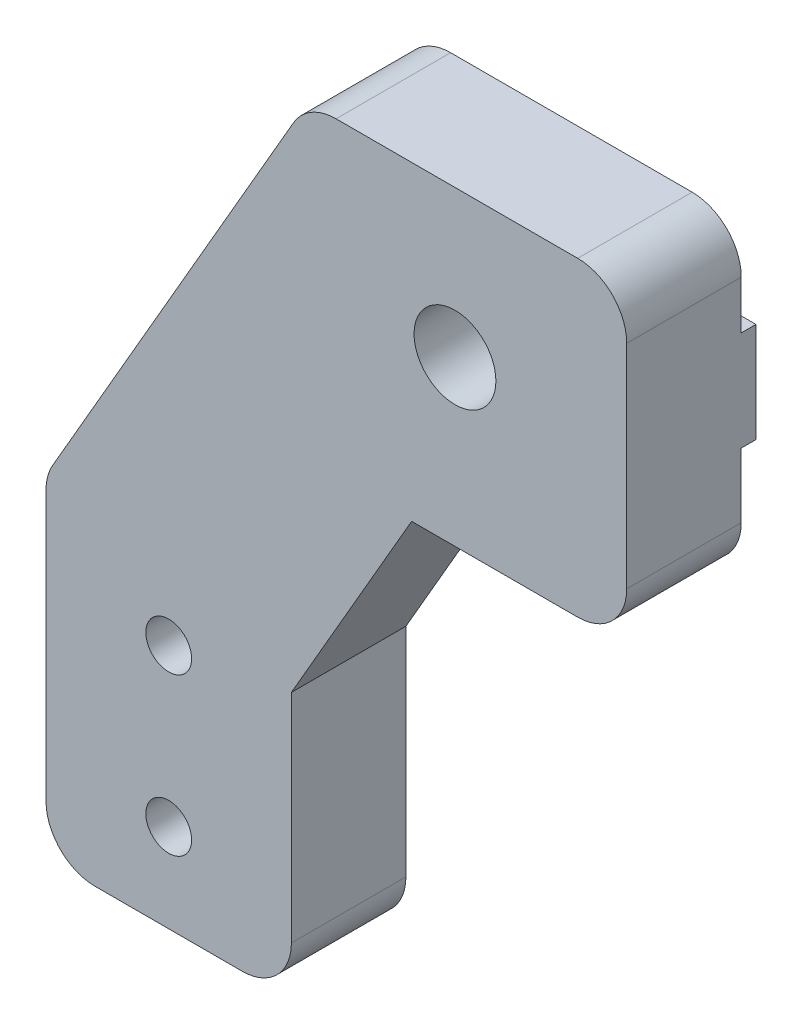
ISO-10303-21;
HEADER;
FILE_DESCRIPTION(('STEP AP214'),'2;1');
FILE_NAME('part.step','',(''),(''),'','','');
FILE_SCHEMA(('AUTOMOTIVE_DESIGN { 1 0 10303 214 1 1 1 1 }'));
ENDSEC;
DATA;
#1=APPLICATION_CONTEXT('core data for automotive mechanical design processes');
#2=APPLICATION_PROTOCOL_DEFINITION('international standard','automotive_design',2000,#1);
#3=PRODUCT_CONTEXT('',#1,'mechanical');
#4=PRODUCT('Part','Part','',(#3));
#5=PRODUCT_RELATED_PRODUCT_CATEGORY('part','',(#4));
#6=PRODUCT_DEFINITION_FORMATION('','',#4);
#7=PRODUCT_DEFINITION_CONTEXT('part definition',#1,'design');
#8=PRODUCT_DEFINITION('design','',#6,#7);
#9=PRODUCT_DEFINITION_SHAPE('','',#8);
#10=(LENGTH_UNIT() NAMED_UNIT(*) SI_UNIT(.MILLI.,.METRE.));
#11=(NAMED_UNIT(*) PLANE_ANGLE_UNIT() SI_UNIT($,.RADIAN.));
#12=(NAMED_UNIT(*) SI_UNIT($,.STERADIAN.) SOLID_ANGLE_UNIT());
#13=UNCERTAINTY_MEASURE_WITH_UNIT(LENGTH_MEASURE(1.E-05),#10,'distance_accuracy_value','');
#14=(GEOMETRIC_REPRESENTATION_CONTEXT(3) GLOBAL_UNCERTAINTY_ASSIGNED_CONTEXT((#13)) GLOBAL_UNIT_ASSIGNED_CONTEXT((#10,
#11,#12)) REPRESENTATION_CONTEXT('',''));
#15=CARTESIAN_POINT('',(0.,0.,0.));
#16=DIRECTION('',(0.,0.,1.));
#17=DIRECTION('',(1.,0.,0.));
#18=AXIS2_PLACEMENT_3D('',#15,#16,#17);
#19=CARTESIAN_POINT('',(3.,19.4833395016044,0.));
#20=DIRECTION('',(0.,0.,-1.));
#21=DIRECTION('',(-1.,0.,0.));
#22=AXIS2_PLACEMENT_3D('',#19,#20,#21);
#23=PLANE('',#22);
#24=CARTESIAN_POINT('',(7.5,15.,0.));
#25=DIRECTION('',(0.,0.,1.));
#26=DIRECTION('',(1.,0.,0.));
#27=AXIS2_PLACEMENT_3D('',#24,#25,#26);
#28=CIRCLE('',#27,1.4);
#29=CARTESIAN_POINT('',(8.9,15.,0.));
#30=VERTEX_POINT('',#29);
#31=EDGE_CURVE('E198',#30,#30,#28,.T.);
#32=ORIENTED_EDGE('',*,*,#31,.T.);
#33=EDGE_LOOP('',(#32));
#34=FACE_BOUND('',#33,.T.);
#35=CARTESIAN_POINT('',(7.5,5.4,0.));
#36=DIRECTION('',(0.,0.,1.));
#37=DIRECTION('',(1.,0.,0.));
#38=AXIS2_PLACEMENT_3D('',#35,#36,#37);
#39=CIRCLE('',#38,1.4);
#40=CARTESIAN_POINT('',(8.9,5.4,0.));
#41=VERTEX_POINT('',#40);
#42=EDGE_CURVE('E197',#41,#41,#39,.T.);
#43=ORIENTED_EDGE('',*,*,#42,.T.);
#44=EDGE_LOOP('',(#43));
#45=FACE_BOUND('',#44,.T.);
#46=DIRECTION('',(-0.499999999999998,-0.86602540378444,0.));
#47=VECTOR('',#46,1.);
#48=CARTESIAN_POINT('',(15.1339745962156,46.5,0.));
#49=LINE('',#48,#47);
#50=CARTESIAN_POINT('',(9.04292925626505,35.95,0.));
#51=VERTEX_POINT('',#50);
#52=CARTESIAN_POINT('',(0.401923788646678,20.9833395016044,0.));
#53=VERTEX_POINT('',#52);
#54=EDGE_CURVE('E55',#51,#53,#49,.T.);
#55=ORIENTED_EDGE('',*,*,#54,.F.);
#56=DIRECTION('',(1.,0.,0.));
#57=VECTOR('',#56,1.);
#58=CARTESIAN_POINT('',(4.16086702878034,35.95,0.));
#59=LINE('',#58,#57);
#60=CARTESIAN_POINT('',(35.5,35.95,0.));
#61=VERTEX_POINT('',#60);
#62=EDGE_CURVE('E50',#51,#61,#59,.T.);
#63=ORIENTED_EDGE('',*,*,#62,.T.);
#64=DIRECTION('',(0.,1.,0.));
#65=VECTOR('',#64,1.);
#66=CARTESIAN_POINT('',(35.5,32.0000000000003,0.));
#67=LINE('',#66,#65);
#68=CARTESIAN_POINT('',(35.5,32.0000000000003,0.));
#69=VERTEX_POINT('',#68);
#70=EDGE_CURVE('E182',#69,#61,#67,.T.);
#71=ORIENTED_EDGE('',*,*,#70,.F.);
#72=CARTESIAN_POINT('',(32.5,32.0000000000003,0.));
#73=DIRECTION('',(0.,0.,1.));
#74=DIRECTION('',(-1.,0.,0.));
#75=AXIS2_PLACEMENT_3D('',#72,#73,#74);
#76=CIRCLE('',#75,3.);
#77=CARTESIAN_POINT('',(32.5,29.0000000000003,0.));
#78=VERTEX_POINT('',#77);
#79=EDGE_CURVE('E257',#78,#69,#76,.T.);
#80=ORIENTED_EDGE('',*,*,#79,.F.);
#81=DIRECTION('',(1.,0.,0.));
#82=VECTOR('',#81,1.);
#83=CARTESIAN_POINT('',(22.3508529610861,29.0000000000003,0.));
#84=LINE('',#83,#82);
#85=CARTESIAN_POINT('',(22.3508529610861,29.0000000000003,0.));
#86=VERTEX_POINT('',#85);
#87=EDGE_CURVE('E255',#86,#78,#84,.T.);
#88=ORIENTED_EDGE('',*,*,#87,.F.);
#89=DIRECTION('',(0.499999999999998,0.86602540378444,0.));
#90=VECTOR('',#89,1.);
#91=CARTESIAN_POINT('',(15.,16.267949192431,0.));
#92=LINE('',#91,#90);
#93=CARTESIAN_POINT('',(15.,16.267949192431,0.));
#94=VERTEX_POINT('',#93);
#95=EDGE_CURVE('E253',#94,#86,#92,.T.);
#96=ORIENTED_EDGE('',*,*,#95,.F.);
#97=DIRECTION('',(0.,1.,0.));
#98=VECTOR('',#97,1.);
#99=CARTESIAN_POINT('',(15.,3.,0.));
#100=LINE('',#99,#98);
#101=CARTESIAN_POINT('',(15.,3.,0.));
#102=VERTEX_POINT('',#101);
#103=EDGE_CURVE('E251',#102,#94,#100,.T.);
#104=ORIENTED_EDGE('',*,*,#103,.F.);
#105=CARTESIAN_POINT('',(12.,3.,0.));
#106=DIRECTION('',(0.,0.,1.));
#107=DIRECTION('',(1.,0.,0.));
#108=AXIS2_PLACEMENT_3D('',#105,#106,#107);
#109=CIRCLE('',#108,3.);
#110=CARTESIAN_POINT('',(12.,0.,0.));
#111=VERTEX_POINT('',#110);
#112=EDGE_CURVE('E249',#111,#102,#109,.T.);
#113=ORIENTED_EDGE('',*,*,#112,.F.);
#114=DIRECTION('',(1.,0.,0.));
#115=VECTOR('',#114,1.);
#116=CARTESIAN_POINT('',(3.00000000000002,0.,0.));
#117=LINE('',#116,#115);
#118=CARTESIAN_POINT('',(3.00000000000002,0.,0.));
#119=VERTEX_POINT('',#118);
#120=EDGE_CURVE('E247',#119,#111,#117,.T.);
#121=ORIENTED_EDGE('',*,*,#120,.F.);
#122=CARTESIAN_POINT('',(3.,3.,0.));
#123=DIRECTION('',(0.,0.,1.));
#124=DIRECTION('',(1.,0.,0.));
#125=AXIS2_PLACEMENT_3D('',#122,#123,#124);
#126=CIRCLE('',#125,3.);
#127=CARTESIAN_POINT('',(0.,3.00000000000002,0.));
#128=VERTEX_POINT('',#127);
#129=EDGE_CURVE('E245',#128,#119,#126,.T.);
#130=ORIENTED_EDGE('',*,*,#129,.F.);
#131=DIRECTION('',(0.,-1.,0.));
#132=VECTOR('',#131,1.);
#133=CARTESIAN_POINT('',(0.,19.4833395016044,0.));
#134=LINE('',#133,#132);
#135=CARTESIAN_POINT('',(0.,19.4833395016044,0.));
#136=VERTEX_POINT('',#135);
#137=EDGE_CURVE('E243',#136,#128,#134,.T.);
#138=ORIENTED_EDGE('',*,*,#137,.F.);
#139=CARTESIAN_POINT('',(3.,19.4833395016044,0.));
#140=DIRECTION('',(0.,0.,1.));
#141=DIRECTION('',(-1.,0.,0.));
#142=AXIS2_PLACEMENT_3D('',#139,#140,#141);
#143=CIRCLE('',#142,3.);
#144=EDGE_CURVE('E209',#53,#136,#143,.T.);
#145=ORIENTED_EDGE('',*,*,#144,.F.);
#146=EDGE_LOOP('',(#55,#63,#71,#80,#88,#96,#104,#113,#121,#130,#138,#145));
#147=FACE_BOUND('',#146,.T.);
#148=ADVANCED_FACE('F33',(#34,#45,#147),#23,.T.);
#149=CARTESIAN_POINT('',(3.,19.4833395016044,7.));
#150=DIRECTION('',(0.,0.,-1.));
#151=DIRECTION('',(-1.,0.,0.));
#152=AXIS2_PLACEMENT_3D('',#149,#150,#151);
#153=PLANE('',#152);
#154=CARTESIAN_POINT('',(3.,19.4833395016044,7.));
#155=DIRECTION('',(0.,0.,1.));
#156=DIRECTION('',(-1.,0.,0.));
#157=AXIS2_PLACEMENT_3D('',#154,#155,#156);
#158=CIRCLE('',#157,3.);
#159=CARTESIAN_POINT('',(0.401923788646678,20.9833395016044,7.));
#160=VERTEX_POINT('',#159);
#161=CARTESIAN_POINT('',(0.,19.4833395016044,7.));
#162=VERTEX_POINT('',#161);
#163=EDGE_CURVE('E210',#160,#162,#158,.T.);
#164=ORIENTED_EDGE('',*,*,#163,.T.);
#165=DIRECTION('',(0.,-1.,0.));
#166=VECTOR('',#165,1.);
#167=CARTESIAN_POINT('',(0.,19.4833395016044,7.));
#168=LINE('',#167,#166);
#169=CARTESIAN_POINT('',(0.,3.00000000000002,7.));
#170=VERTEX_POINT('',#169);
#171=EDGE_CURVE('E213',#162,#170,#168,.T.);
#172=ORIENTED_EDGE('',*,*,#171,.T.);
#173=CARTESIAN_POINT('',(3.,3.,7.));
#174=DIRECTION('',(0.,0.,1.));
#175=DIRECTION('',(1.,0.,0.));
#176=AXIS2_PLACEMENT_3D('',#173,#174,#175);
#177=CIRCLE('',#176,3.);
#178=CARTESIAN_POINT('',(3.00000000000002,0.,7.));
#179=VERTEX_POINT('',#178);
#180=EDGE_CURVE('E216',#170,#179,#177,.T.);
#181=ORIENTED_EDGE('',*,*,#180,.T.);
#182=DIRECTION('',(1.,0.,0.));
#183=VECTOR('',#182,1.);
#184=CARTESIAN_POINT('',(3.00000000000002,0.,7.));
#185=LINE('',#184,#183);
#186=CARTESIAN_POINT('',(12.,0.,7.));
#187=VERTEX_POINT('',#186);
#188=EDGE_CURVE('E218',#179,#187,#185,.T.);
#189=ORIENTED_EDGE('',*,*,#188,.T.);
#190=CARTESIAN_POINT('',(12.,3.,7.));
#191=DIRECTION('',(0.,0.,1.));
#192=DIRECTION('',(1.,0.,0.));
#193=AXIS2_PLACEMENT_3D('',#190,#191,#192);
#194=CIRCLE('',#193,3.);
#195=CARTESIAN_POINT('',(15.,3.,7.));
#196=VERTEX_POINT('',#195);
#197=EDGE_CURVE('E220',#187,#196,#194,.T.);
#198=ORIENTED_EDGE('',*,*,#197,.T.);
#199=DIRECTION('',(0.,1.,0.));
#200=VECTOR('',#199,1.);
#201=CARTESIAN_POINT('',(15.,3.,7.));
#202=LINE('',#201,#200);
#203=CARTESIAN_POINT('',(15.,16.267949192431,7.));
#204=VERTEX_POINT('',#203);
#205=EDGE_CURVE('E222',#196,#204,#202,.T.);
#206=ORIENTED_EDGE('',*,*,#205,.T.);
#207=DIRECTION('',(0.499999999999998,0.86602540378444,0.));
#208=VECTOR('',#207,1.);
#209=CARTESIAN_POINT('',(15.,16.267949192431,7.));
#210=LINE('',#209,#208);
#211=CARTESIAN_POINT('',(22.3508529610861,29.0000000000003,7.));
#212=VERTEX_POINT('',#211);
#213=EDGE_CURVE('E224',#204,#212,#210,.T.);
#214=ORIENTED_EDGE('',*,*,#213,.T.);
#215=DIRECTION('',(1.,0.,0.));
#216=VECTOR('',#215,1.);
#217=CARTESIAN_POINT('',(22.3508529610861,29.0000000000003,7.));
#218=LINE('',#217,#216);
#219=CARTESIAN_POINT('',(32.5,29.0000000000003,7.));
#220=VERTEX_POINT('',#219);
#221=EDGE_CURVE('E226',#212,#220,#218,.T.);
#222=ORIENTED_EDGE('',*,*,#221,.T.);
#223=CARTESIAN_POINT('',(32.5,32.0000000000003,7.));
#224=DIRECTION('',(0.,0.,1.));
#225=DIRECTION('',(-1.,0.,0.));
#226=AXIS2_PLACEMENT_3D('',#223,#224,#225);
#227=CIRCLE('',#226,3.);
#228=CARTESIAN_POINT('',(35.5,32.0000000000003,7.));
#229=VERTEX_POINT('',#228);
#230=EDGE_CURVE('E228',#220,#229,#227,.T.);
#231=ORIENTED_EDGE('',*,*,#230,.T.);
#232=DIRECTION('',(0.,1.,0.));
#233=VECTOR('',#232,1.);
#234=CARTESIAN_POINT('',(35.5,32.0000000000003,7.));
#235=LINE('',#234,#233);
#236=CARTESIAN_POINT('',(35.5,45.,7.));
#237=VERTEX_POINT('',#236);
#238=EDGE_CURVE('E230',#229,#237,#235,.T.);
#239=ORIENTED_EDGE('',*,*,#238,.T.);
#240=CARTESIAN_POINT('',(32.5,45.,7.));
#241=DIRECTION('',(0.,0.,1.));
#242=DIRECTION('',(1.,0.,0.));
#243=AXIS2_PLACEMENT_3D('',#240,#241,#242);
#244=CIRCLE('',#243,3.);
#245=CARTESIAN_POINT('',(32.5,48.,7.));
#246=VERTEX_POINT('',#245);
#247=EDGE_CURVE('E232',#237,#246,#244,.T.);
#248=ORIENTED_EDGE('',*,*,#247,.T.);
#249=DIRECTION('',(-1.,0.,0.));
#250=VECTOR('',#249,1.);
#251=CARTESIAN_POINT('',(32.5,48.,7.));
#252=LINE('',#251,#250);
#253=CARTESIAN_POINT('',(17.7320508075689,48.,7.));
#254=VERTEX_POINT('',#253);
#255=EDGE_CURVE('E234',#246,#254,#252,.T.);
#256=ORIENTED_EDGE('',*,*,#255,.T.);
#257=CARTESIAN_POINT('',(17.7320508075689,45.,7.));
#258=DIRECTION('',(0.,0.,1.));
#259=DIRECTION('',(-1.,0.,0.));
#260=AXIS2_PLACEMENT_3D('',#257,#258,#259);
#261=CIRCLE('',#260,3.00000000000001);
#262=CARTESIAN_POINT('',(15.1339745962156,46.5,7.));
#263=VERTEX_POINT('',#262);
#264=EDGE_CURVE('E236',#254,#263,#261,.T.);
#265=ORIENTED_EDGE('',*,*,#264,.T.);
#266=DIRECTION('',(-0.499999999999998,-0.86602540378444,0.));
#267=VECTOR('',#266,1.);
#268=CARTESIAN_POINT('',(15.1339745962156,46.5,7.));
#269=LINE('',#268,#267);
#270=EDGE_CURVE('E238',#263,#160,#269,.T.);
#271=ORIENTED_EDGE('',*,*,#270,.T.);
#272=EDGE_LOOP('',(#164,#172,#181,#189,#198,#206,#214,#222,#231,#239,#248,#256,#265,#271));
#273=FACE_BOUND('',#272,.T.);
#274=CARTESIAN_POINT('',(25.,39.,7.));
#275=DIRECTION('',(0.,0.,1.));
#276=DIRECTION('',(1.,0.,0.));
#277=AXIS2_PLACEMENT_3D('',#274,#275,#276);
#278=CIRCLE('',#277,2.50000000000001);
#279=CARTESIAN_POINT('',(27.5,39.,7.));
#280=VERTEX_POINT('',#279);
#281=EDGE_CURVE('E204',#280,#280,#278,.T.);
#282=ORIENTED_EDGE('',*,*,#281,.F.);
#283=EDGE_LOOP('',(#282));
#284=FACE_BOUND('',#283,.T.);
#285=CARTESIAN_POINT('',(7.5,5.4,7.));
#286=DIRECTION('',(0.,0.,1.));
#287=DIRECTION('',(1.,0.,0.));
#288=AXIS2_PLACEMENT_3D('',#285,#286,#287);
#289=CIRCLE('',#288,1.4);
#290=CARTESIAN_POINT('',(8.9,5.4,7.));
#291=VERTEX_POINT('',#290);
#292=EDGE_CURVE('E201',#291,#291,#289,.T.);
#293=ORIENTED_EDGE('',*,*,#292,.F.);
#294=EDGE_LOOP('',(#293));
#295=FACE_BOUND('',#294,.T.);
#296=CARTESIAN_POINT('',(7.5,15.,7.));
#297=DIRECTION('',(0.,0.,1.));
#298=DIRECTION('',(1.,0.,0.));
#299=AXIS2_PLACEMENT_3D('',#296,#297,#298);
#300=CIRCLE('',#299,1.4);
#301=CARTESIAN_POINT('',(8.9,15.,7.));
#302=VERTEX_POINT('',#301);
#303=EDGE_CURVE('E194',#302,#302,#300,.T.);
#304=ORIENTED_EDGE('',*,*,#303,.F.);
#305=EDGE_LOOP('',(#304));
#306=FACE_BOUND('',#305,.T.);
#307=ADVANCED_FACE('F331',(#273,#284,#295,#306),#153,.F.);
#308=DIRECTION('',(1.,0.,0.));
#309=VECTOR('',#308,1.);
#310=CARTESIAN_POINT('',(4.16086702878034,42.05,0.));
#311=LINE('',#310,#309);
#312=CARTESIAN_POINT('',(12.5647658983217,42.05,0.));
#313=VERTEX_POINT('',#312);
#314=CARTESIAN_POINT('',(35.5,42.05,0.));
#315=VERTEX_POINT('',#314);
#316=EDGE_CURVE('E352',#313,#315,#311,.T.);
#317=ORIENTED_EDGE('',*,*,#316,.F.);
#318=CARTESIAN_POINT('',(15.1339745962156,46.5,0.));
#319=VERTEX_POINT('',#318);
#320=EDGE_CURVE('E214',#319,#313,#49,.T.);
#321=ORIENTED_EDGE('',*,*,#320,.F.);
#322=CARTESIAN_POINT('',(17.7320508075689,45.,0.));
#323=DIRECTION('',(0.,0.,1.));
#324=DIRECTION('',(-1.,0.,0.));
#325=AXIS2_PLACEMENT_3D('',#322,#323,#324);
#326=CIRCLE('',#325,3.00000000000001);
#327=CARTESIAN_POINT('',(17.7320508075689,48.,0.));
#328=VERTEX_POINT('',#327);
#329=EDGE_CURVE('E271',#328,#319,#326,.T.);
#330=ORIENTED_EDGE('',*,*,#329,.F.);
#331=DIRECTION('',(-1.,0.,0.));
#332=VECTOR('',#331,1.);
#333=CARTESIAN_POINT('',(32.5,48.,0.));
#334=LINE('',#333,#332);
#335=CARTESIAN_POINT('',(32.5,48.,0.));
#336=VERTEX_POINT('',#335);
#337=EDGE_CURVE('E370',#336,#328,#334,.T.);
#338=ORIENTED_EDGE('',*,*,#337,.F.);
#339=CARTESIAN_POINT('',(32.5,45.,0.));
#340=DIRECTION('',(0.,0.,1.));
#341=DIRECTION('',(1.,0.,0.));
#342=AXIS2_PLACEMENT_3D('',#339,#340,#341);
#343=CIRCLE('',#342,3.);
#344=CARTESIAN_POINT('',(35.5,45.,0.));
#345=VERTEX_POINT('',#344);
#346=EDGE_CURVE('E262',#345,#336,#343,.T.);
#347=ORIENTED_EDGE('',*,*,#346,.F.);
#348=EDGE_CURVE('E259',#315,#345,#67,.T.);
#349=ORIENTED_EDGE('',*,*,#348,.F.);
#350=EDGE_LOOP('',(#317,#321,#330,#338,#347,#349));
#351=FACE_BOUND('',#350,.T.);
#352=ADVANCED_FACE('F368',(#351),#23,.T.);
#353=CARTESIAN_POINT('',(3.,19.4833395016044,7.));
#354=DIRECTION('',(0.,0.,-1.));
#355=DIRECTION('',(-1.,0.,0.));
#356=AXIS2_PLACEMENT_3D('',#353,#354,#355);
#357=CYLINDRICAL_SURFACE('',#356,3.);
#358=ORIENTED_EDGE('',*,*,#144,.T.);
#359=DIRECTION('',(0.,0.,-1.));
#360=VECTOR('',#359,1.);
#361=CARTESIAN_POINT('',(0.,19.4833395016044,7.));
#362=LINE('',#361,#360);
#363=EDGE_CURVE('E11',#162,#136,#362,.T.);
#364=ORIENTED_EDGE('',*,*,#363,.F.);
#365=ORIENTED_EDGE('',*,*,#163,.F.);
#366=DIRECTION('',(0.,0.,-1.));
#367=VECTOR('',#366,1.);
#368=CARTESIAN_POINT('',(0.401923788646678,20.9833395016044,7.));
#369=LINE('',#368,#367);
#370=EDGE_CURVE('E240',#160,#53,#369,.T.);
#371=ORIENTED_EDGE('',*,*,#370,.T.);
#372=EDGE_LOOP('',(#358,#364,#365,#371));
#373=FACE_BOUND('',#372,.T.);
#374=ADVANCED_FACE('F35',(#373),#357,.T.);
#375=CARTESIAN_POINT('',(0.,19.4833395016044,7.));
#376=DIRECTION('',(1.,0.,0.));
#377=DIRECTION('',(0.,0.,-1.));
#378=AXIS2_PLACEMENT_3D('',#375,#376,#377);
#379=PLANE('',#378);
#380=ORIENTED_EDGE('',*,*,#137,.T.);
#381=DIRECTION('',(0.,0.,-1.));
#382=VECTOR('',#381,1.);
#383=CARTESIAN_POINT('',(0.,3.00000000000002,7.));
#384=LINE('',#383,#382);
#385=EDGE_CURVE('E42',#170,#128,#384,.T.);
#386=ORIENTED_EDGE('',*,*,#385,.F.);
#387=ORIENTED_EDGE('',*,*,#171,.F.);
#388=ORIENTED_EDGE('',*,*,#363,.T.);
#389=EDGE_LOOP('',(#380,#386,#387,#388));
#390=FACE_BOUND('',#389,.T.);
#391=ADVANCED_FACE('F336',(#390),#379,.F.);
#392=CARTESIAN_POINT('',(3.,3.,7.));
#393=DIRECTION('',(0.,0.,-1.));
#394=DIRECTION('',(-1.,0.,0.));
#395=AXIS2_PLACEMENT_3D('',#392,#393,#394);
#396=CYLINDRICAL_SURFACE('',#395,3.);
#397=ORIENTED_EDGE('',*,*,#129,.T.);
#398=DIRECTION('',(0.,0.,-1.));
#399=VECTOR('',#398,1.);
#400=CARTESIAN_POINT('',(3.00000000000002,0.,7.));
#401=LINE('',#400,#399);
#402=EDGE_CURVE('E307',#179,#119,#401,.T.);
#403=ORIENTED_EDGE('',*,*,#402,.F.);
#404=ORIENTED_EDGE('',*,*,#180,.F.);
#405=ORIENTED_EDGE('',*,*,#385,.T.);
#406=EDGE_LOOP('',(#397,#403,#404,#405));
#407=FACE_BOUND('',#406,.T.);
#408=ADVANCED_FACE('F315',(#407),#396,.T.);
#409=CARTESIAN_POINT('',(3.00000000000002,0.,7.));
#410=DIRECTION('',(0.,1.,0.));
#411=DIRECTION('',(0.,0.,1.));
#412=AXIS2_PLACEMENT_3D('',#409,#410,#411);
#413=PLANE('',#412);
#414=ORIENTED_EDGE('',*,*,#120,.T.);
#415=DIRECTION('',(0.,0.,-1.));
#416=VECTOR('',#415,1.);
#417=CARTESIAN_POINT('',(12.,0.,7.));
#418=LINE('',#417,#416);
#419=EDGE_CURVE('E304',#187,#111,#418,.T.);
#420=ORIENTED_EDGE('',*,*,#419,.F.);
#421=ORIENTED_EDGE('',*,*,#188,.F.);
#422=ORIENTED_EDGE('',*,*,#402,.T.);
#423=EDGE_LOOP('',(#414,#420,#421,#422));
#424=FACE_BOUND('',#423,.T.);
#425=ADVANCED_FACE('F323',(#424),#413,.F.);
#426=CARTESIAN_POINT('',(12.,3.,7.));
#427=DIRECTION('',(0.,0.,-1.));
#428=DIRECTION('',(-1.,0.,0.));
#429=AXIS2_PLACEMENT_3D('',#426,#427,#428);
#430=CYLINDRICAL_SURFACE('',#429,3.);
#431=ORIENTED_EDGE('',*,*,#112,.T.);
#432=DIRECTION('',(0.,0.,-1.));
#433=VECTOR('',#432,1.);
#434=CARTESIAN_POINT('',(15.,3.,7.));
#435=LINE('',#434,#433);
#436=EDGE_CURVE('E301',#196,#102,#435,.T.);
#437=ORIENTED_EDGE('',*,*,#436,.F.);
#438=ORIENTED_EDGE('',*,*,#197,.F.);
#439=ORIENTED_EDGE('',*,*,#419,.T.);
#440=EDGE_LOOP('',(#431,#437,#438,#439));
#441=FACE_BOUND('',#440,.T.);
#442=ADVANCED_FACE('F327',(#441),#430,.T.);
#443=CARTESIAN_POINT('',(15.,3.,7.));
#444=DIRECTION('',(-1.,0.,0.));
#445=DIRECTION('',(0.,0.,1.));
#446=AXIS2_PLACEMENT_3D('',#443,#444,#445);
#447=PLANE('',#446);
#448=ORIENTED_EDGE('',*,*,#103,.T.);
#449=DIRECTION('',(0.,0.,-1.));
#450=VECTOR('',#449,1.);
#451=CARTESIAN_POINT('',(15.,16.267949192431,7.));
#452=LINE('',#451,#450);
#453=EDGE_CURVE('E298',#204,#94,#452,.T.);
#454=ORIENTED_EDGE('',*,*,#453,.F.);
#455=ORIENTED_EDGE('',*,*,#205,.F.);
#456=ORIENTED_EDGE('',*,*,#436,.T.);
#457=EDGE_LOOP('',(#448,#454,#455,#456));
#458=FACE_BOUND('',#457,.T.);
#459=ADVANCED_FACE('F396',(#458),#447,.F.);
#460=CARTESIAN_POINT('',(15.,16.267949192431,7.));
#461=DIRECTION('',(-0.86602540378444,0.499999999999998,0.));
#462=DIRECTION('',(-0.499999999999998,-0.86602540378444,0.));
#463=AXIS2_PLACEMENT_3D('',#460,#461,#462);
#464=PLANE('',#463);
#465=ORIENTED_EDGE('',*,*,#95,.T.);
#466=DIRECTION('',(0.,0.,-1.));
#467=VECTOR('',#466,1.);
#468=CARTESIAN_POINT('',(22.3508529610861,29.0000000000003,7.));
#469=LINE('',#468,#467);
#470=EDGE_CURVE('E295',#212,#86,#469,.T.);
#471=ORIENTED_EDGE('',*,*,#470,.F.);
#472=ORIENTED_EDGE('',*,*,#213,.F.);
#473=ORIENTED_EDGE('',*,*,#453,.T.);
#474=EDGE_LOOP('',(#465,#471,#472,#473));
#475=FACE_BOUND('',#474,.T.);
#476=ADVANCED_FACE('F394',(#475),#464,.F.);
#477=CARTESIAN_POINT('',(22.3508529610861,29.0000000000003,7.));
#478=DIRECTION('',(0.,1.,0.));
#479=DIRECTION('',(-1.,0.,0.));
#480=AXIS2_PLACEMENT_3D('',#477,#478,#479);
#481=PLANE('',#480);
#482=ORIENTED_EDGE('',*,*,#87,.T.);
#483=DIRECTION('',(0.,0.,-1.));
#484=VECTOR('',#483,1.);
#485=CARTESIAN_POINT('',(32.5,29.0000000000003,7.));
#486=LINE('',#485,#484);
#487=EDGE_CURVE('E292',#220,#78,#486,.T.);
#488=ORIENTED_EDGE('',*,*,#487,.F.);
#489=ORIENTED_EDGE('',*,*,#221,.F.);
#490=ORIENTED_EDGE('',*,*,#470,.T.);
#491=EDGE_LOOP('',(#482,#488,#489,#490));
#492=FACE_BOUND('',#491,.T.);
#493=ADVANCED_FACE('F390',(#492),#481,.F.);
#494=CARTESIAN_POINT('',(32.5,32.0000000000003,7.));
#495=DIRECTION('',(0.,0.,-1.));
#496=DIRECTION('',(-1.,0.,0.));
#497=AXIS2_PLACEMENT_3D('',#494,#495,#496);
#498=CYLINDRICAL_SURFACE('',#497,3.);
#499=ORIENTED_EDGE('',*,*,#79,.T.);
#500=DIRECTION('',(0.,0.,-1.));
#501=VECTOR('',#500,1.);
#502=CARTESIAN_POINT('',(35.5,32.0000000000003,7.));
#503=LINE('',#502,#501);
#504=EDGE_CURVE('E290',#229,#69,#503,.T.);
#505=ORIENTED_EDGE('',*,*,#504,.F.);
#506=ORIENTED_EDGE('',*,*,#230,.F.);
#507=ORIENTED_EDGE('',*,*,#487,.T.);
#508=EDGE_LOOP('',(#499,#505,#506,#507));
#509=FACE_BOUND('',#508,.T.);
#510=ADVANCED_FACE('F386',(#509),#498,.T.);
#511=CARTESIAN_POINT('',(35.5,32.0000000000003,7.));
#512=DIRECTION('',(-1.,0.,0.));
#513=DIRECTION('',(0.,0.,1.));
#514=AXIS2_PLACEMENT_3D('',#511,#512,#513);
#515=PLANE('',#514);
#516=ORIENTED_EDGE('',*,*,#70,.T.);
#517=DIRECTION('',(0.,0.,-1.));
#518=VECTOR('',#517,1.);
#519=CARTESIAN_POINT('',(35.5,35.95,0.));
#520=LINE('',#519,#518);
#521=CARTESIAN_POINT('',(35.5,35.95,-0.900000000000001));
#522=VERTEX_POINT('',#521);
#523=EDGE_CURVE('E165',#61,#522,#520,.T.);
#524=ORIENTED_EDGE('',*,*,#523,.T.);
#525=DIRECTION('',(0.,-1.,0.));
#526=VECTOR('',#525,1.);
#527=CARTESIAN_POINT('',(35.5,42.05,-0.9));
#528=LINE('',#527,#526);
#529=CARTESIAN_POINT('',(35.5,42.05,-0.9));
#530=VERTEX_POINT('',#529);
#531=EDGE_CURVE('E172',#530,#522,#528,.T.);
#532=ORIENTED_EDGE('',*,*,#531,.F.);
#533=DIRECTION('',(0.,0.,-1.));
#534=VECTOR('',#533,1.);
#535=CARTESIAN_POINT('',(35.5,42.05,0.));
#536=LINE('',#535,#534);
#537=EDGE_CURVE('E178',#315,#530,#536,.T.);
#538=ORIENTED_EDGE('',*,*,#537,.F.);
#539=ORIENTED_EDGE('',*,*,#348,.T.);
#540=DIRECTION('',(0.,0.,-1.));
#541=VECTOR('',#540,1.);
#542=CARTESIAN_POINT('',(35.5,45.,7.));
#543=LINE('',#542,#541);
#544=EDGE_CURVE('E287',#237,#345,#543,.T.);
#545=ORIENTED_EDGE('',*,*,#544,.F.);
#546=ORIENTED_EDGE('',*,*,#238,.F.);
#547=ORIENTED_EDGE('',*,*,#504,.T.);
#548=EDGE_LOOP('',(#516,#524,#532,#538,#539,#545,#546,#547));
#549=FACE_BOUND('',#548,.T.);
#550=ADVANCED_FACE('F180',(#549),#515,.F.);
#551=CARTESIAN_POINT('',(32.5,45.,7.));
#552=DIRECTION('',(0.,0.,-1.));
#553=DIRECTION('',(-1.,0.,0.));
#554=AXIS2_PLACEMENT_3D('',#551,#552,#553);
#555=CYLINDRICAL_SURFACE('',#554,3.);
#556=ORIENTED_EDGE('',*,*,#346,.T.);
#557=DIRECTION('',(0.,0.,-1.));
#558=VECTOR('',#557,1.);
#559=CARTESIAN_POINT('',(32.5,48.,7.));
#560=LINE('',#559,#558);
#561=EDGE_CURVE('E284',#246,#336,#560,.T.);
#562=ORIENTED_EDGE('',*,*,#561,.F.);
#563=ORIENTED_EDGE('',*,*,#247,.F.);
#564=ORIENTED_EDGE('',*,*,#544,.T.);
#565=EDGE_LOOP('',(#556,#562,#563,#564));
#566=FACE_BOUND('',#565,.T.);
#567=ADVANCED_FACE('F365',(#566),#555,.T.);
#568=CARTESIAN_POINT('',(32.5,48.,7.));
#569=DIRECTION('',(0.,-1.,0.));
#570=DIRECTION('',(0.,0.,-1.));
#571=AXIS2_PLACEMENT_3D('',#568,#569,#570);
#572=PLANE('',#571);
#573=ORIENTED_EDGE('',*,*,#337,.T.);
#574=DIRECTION('',(0.,0.,-1.));
#575=VECTOR('',#574,1.);
#576=CARTESIAN_POINT('',(17.7320508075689,48.,7.));
#577=LINE('',#576,#575);
#578=EDGE_CURVE('E281',#254,#328,#577,.T.);
#579=ORIENTED_EDGE('',*,*,#578,.F.);
#580=ORIENTED_EDGE('',*,*,#255,.F.);
#581=ORIENTED_EDGE('',*,*,#561,.T.);
#582=EDGE_LOOP('',(#573,#579,#580,#581));
#583=FACE_BOUND('',#582,.T.);
#584=ADVANCED_FACE('F379',(#583),#572,.F.);
#585=CARTESIAN_POINT('',(17.7320508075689,45.,7.));
#586=DIRECTION('',(0.,0.,-1.));
#587=DIRECTION('',(-1.,0.,0.));
#588=AXIS2_PLACEMENT_3D('',#585,#586,#587);
#589=CYLINDRICAL_SURFACE('',#588,3.00000000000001);
#590=ORIENTED_EDGE('',*,*,#329,.T.);
#591=DIRECTION('',(0.,0.,-1.));
#592=VECTOR('',#591,1.);
#593=CARTESIAN_POINT('',(15.1339745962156,46.5,7.));
#594=LINE('',#593,#592);
#595=EDGE_CURVE('E278',#263,#319,#594,.T.);
#596=ORIENTED_EDGE('',*,*,#595,.F.);
#597=ORIENTED_EDGE('',*,*,#264,.F.);
#598=ORIENTED_EDGE('',*,*,#578,.T.);
#599=EDGE_LOOP('',(#590,#596,#597,#598));
#600=FACE_BOUND('',#599,.T.);
#601=ADVANCED_FACE('F375',(#600),#589,.T.);
#602=CARTESIAN_POINT('',(15.1339745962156,46.5,7.));
#603=DIRECTION('',(0.86602540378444,-0.499999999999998,0.));
#604=DIRECTION('',(0.499999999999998,0.86602540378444,0.));
#605=AXIS2_PLACEMENT_3D('',#602,#603,#604);
#606=PLANE('',#605);
#607=ORIENTED_EDGE('',*,*,#320,.T.);
#608=DIRECTION('',(0.,0.,1.));
#609=VECTOR('',#608,1.);
#610=CARTESIAN_POINT('',(12.5647658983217,42.05,0.));
#611=LINE('',#610,#609);
#612=CARTESIAN_POINT('',(12.5647658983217,42.05,-0.9));
#613=VERTEX_POINT('',#612);
#614=EDGE_CURVE('E344',#613,#313,#611,.T.);
#615=ORIENTED_EDGE('',*,*,#614,.F.);
#616=DIRECTION('',(0.499999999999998,0.86602540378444,0.));
#617=VECTOR('',#616,1.);
#618=CARTESIAN_POINT('',(10.4637911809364,38.4110050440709,-0.9));
#619=LINE('',#618,#617);
#620=CARTESIAN_POINT('',(9.04292925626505,35.95,-0.900000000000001));
#621=VERTEX_POINT('',#620);
#622=EDGE_CURVE('E343',#621,#613,#619,.T.);
#623=ORIENTED_EDGE('',*,*,#622,.F.);
#624=DIRECTION('',(0.,0.,1.));
#625=VECTOR('',#624,1.);
#626=CARTESIAN_POINT('',(9.04292925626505,35.95,0.));
#627=LINE('',#626,#625);
#628=EDGE_CURVE('E166',#621,#51,#627,.T.);
#629=ORIENTED_EDGE('',*,*,#628,.T.);
#630=ORIENTED_EDGE('',*,*,#54,.T.);
#631=ORIENTED_EDGE('',*,*,#370,.F.);
#632=ORIENTED_EDGE('',*,*,#270,.F.);
#633=ORIENTED_EDGE('',*,*,#595,.T.);
#634=EDGE_LOOP('',(#607,#615,#623,#629,#630,#631,#632,#633));
#635=FACE_BOUND('',#634,.T.);
#636=ADVANCED_FACE('F342',(#635),#606,.F.);
#637=CARTESIAN_POINT('',(25.,39.,7.));
#638=DIRECTION('',(0.,0.,-1.));
#639=DIRECTION('',(-1.,0.,0.));
#640=AXIS2_PLACEMENT_3D('',#637,#638,#639);
#641=CYLINDRICAL_SURFACE('',#640,2.50000000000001);
#642=ORIENTED_EDGE('',*,*,#281,.T.);
#643=EDGE_LOOP('',(#642));
#644=FACE_BOUND('',#643,.T.);
#645=CARTESIAN_POINT('',(25.,39.,-0.9));
#646=DIRECTION('',(0.,0.,1.));
#647=DIRECTION('',(0.,-1.,0.));
#648=AXIS2_PLACEMENT_3D('',#645,#646,#647);
#649=CIRCLE('',#648,2.5);
#650=CARTESIAN_POINT('',(25.,36.5,-0.9));
#651=VERTEX_POINT('',#650);
#652=EDGE_CURVE('E183',#651,#651,#649,.F.);
#653=ORIENTED_EDGE('',*,*,#652,.T.);
#654=EDGE_LOOP('',(#653));
#655=FACE_BOUND('',#654,.T.);
#656=ADVANCED_FACE('F500',(#644,#655),#641,.F.);
#657=CARTESIAN_POINT('',(7.5,5.4,7.));
#658=DIRECTION('',(0.,0.,-1.));
#659=DIRECTION('',(-1.,0.,0.));
#660=AXIS2_PLACEMENT_3D('',#657,#658,#659);
#661=CYLINDRICAL_SURFACE('',#660,1.4);
#662=ORIENTED_EDGE('',*,*,#292,.T.);
#663=EDGE_LOOP('',(#662));
#664=FACE_BOUND('',#663,.T.);
#665=ORIENTED_EDGE('',*,*,#42,.F.);
#666=EDGE_LOOP('',(#665));
#667=FACE_BOUND('',#666,.T.);
#668=ADVANCED_FACE('F494',(#664,#667),#661,.F.);
#669=CARTESIAN_POINT('',(7.5,15.,7.));
#670=DIRECTION('',(0.,0.,-1.));
#671=DIRECTION('',(-1.,0.,0.));
#672=AXIS2_PLACEMENT_3D('',#669,#670,#671);
#673=CYLINDRICAL_SURFACE('',#672,1.4);
#674=ORIENTED_EDGE('',*,*,#303,.T.);
#675=EDGE_LOOP('',(#674));
#676=FACE_BOUND('',#675,.T.);
#677=ORIENTED_EDGE('',*,*,#31,.F.);
#678=EDGE_LOOP('',(#677));
#679=FACE_BOUND('',#678,.T.);
#680=ADVANCED_FACE('F499',(#676,#679),#673,.F.);
#681=CARTESIAN_POINT('',(4.16086702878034,35.95,0.));
#682=DIRECTION('',(0.,-1.,0.));
#683=DIRECTION('',(0.,0.,-1.));
#684=AXIS2_PLACEMENT_3D('',#681,#682,#683);
#685=PLANE('',#684);
#686=ORIENTED_EDGE('',*,*,#628,.F.);
#687=DIRECTION('',(1.,0.,0.));
#688=VECTOR('',#687,1.);
#689=CARTESIAN_POINT('',(4.16086702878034,35.95,-0.900000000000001));
#690=LINE('',#689,#688);
#691=EDGE_CURVE('E161',#621,#522,#690,.T.);
#692=ORIENTED_EDGE('',*,*,#691,.T.);
#693=ORIENTED_EDGE('',*,*,#523,.F.);
#694=ORIENTED_EDGE('',*,*,#62,.F.);
#695=EDGE_LOOP('',(#686,#692,#693,#694));
#696=FACE_BOUND('',#695,.T.);
#697=ADVANCED_FACE('F163',(#696),#685,.T.);
#698=CARTESIAN_POINT('',(4.16086702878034,42.05,-0.9));
#699=DIRECTION('',(0.,0.,1.));
#700=DIRECTION('',(0.,-1.,0.));
#701=AXIS2_PLACEMENT_3D('',#698,#699,#700);
#702=PLANE('',#701);
#703=ORIENTED_EDGE('',*,*,#652,.F.);
#704=EDGE_LOOP('',(#703));
#705=FACE_BOUND('',#704,.T.);
#706=ORIENTED_EDGE('',*,*,#691,.F.);
#707=ORIENTED_EDGE('',*,*,#622,.T.);
#708=DIRECTION('',(1.,0.,0.));
#709=VECTOR('',#708,1.);
#710=CARTESIAN_POINT('',(4.16086702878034,42.05,-0.9));
#711=LINE('',#710,#709);
#712=EDGE_CURVE('E169',#613,#530,#711,.T.);
#713=ORIENTED_EDGE('',*,*,#712,.T.);
#714=ORIENTED_EDGE('',*,*,#531,.T.);
#715=EDGE_LOOP('',(#706,#707,#713,#714));
#716=FACE_BOUND('',#715,.T.);
#717=ADVANCED_FACE('F173',(#705,#716),#702,.F.);
#718=CARTESIAN_POINT('',(4.16086702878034,42.05,0.));
#719=DIRECTION('',(0.,-1.,0.));
#720=DIRECTION('',(0.,0.,-1.));
#721=AXIS2_PLACEMENT_3D('',#718,#719,#720);
#722=PLANE('',#721);
#723=ORIENTED_EDGE('',*,*,#712,.F.);
#724=ORIENTED_EDGE('',*,*,#614,.T.);
#725=ORIENTED_EDGE('',*,*,#316,.T.);
#726=ORIENTED_EDGE('',*,*,#537,.T.);
#727=EDGE_LOOP('',(#723,#724,#725,#726));
#728=FACE_BOUND('',#727,.T.);
#729=ADVANCED_FACE('F358',(#728),#722,.F.);
#730=CLOSED_SHELL('',(#148,#307,#352,#374,#391,#408,#425,#442,#459,#476,#493,#510,#550,#567,
#584,#601,#636,#656,#668,#680,#697,#717,#729));
#731=MANIFOLD_SOLID_BREP('B2',#730);
#732=ADVANCED_BREP_SHAPE_REPRESENTATION('',(#18,#731),#14);
#733=SHAPE_DEFINITION_REPRESENTATION(#9,#732);
ENDSEC;
END-ISO-10303-21;
